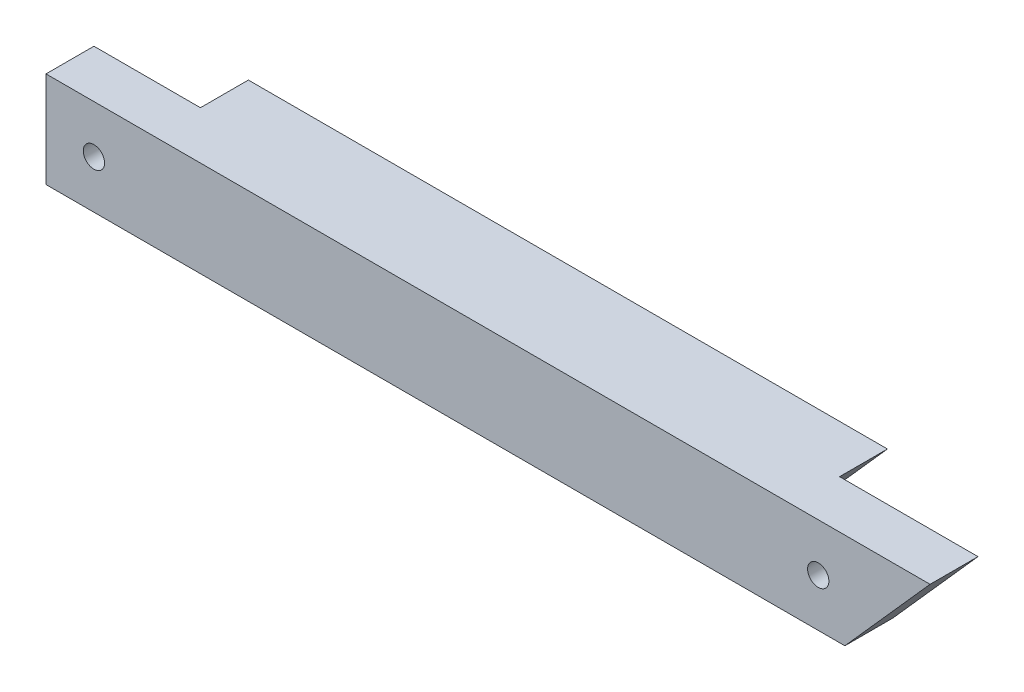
from build123d import *

# Parameters (mm, degrees)
ESQUISSE1_W             = 83
ESQUISSE1_H             = 9
EXTRUSION1_DEPTH        = 9
ESQUISSE2_W             = 10
ESQUISSE2_H             = 9
ENL_V_MAT_EXTRU_1_DEPTH = 4.5
ESQUISSE3_R             = 1
ENL_V_MAT_EXTRU_2_DEPTH = 4.5
ENL_V_MAT_EXTRU_3_DEPTH = 9
ENL_V_MAT_EXTRU_4_DEPTH = 4.5
ESQUISSE6_R             = 1
ENL_V_MAT_EXTRU_5_DEPTH = 4.5


with BuildPart() as part:
    # Esquisse1 → Extrusion1 (new body)
    with BuildSketch(Plane.XY):
        with Locations((41.5, 4.5)):
            Rectangle(ESQUISSE1_W, ESQUISSE1_H)
    extrude(amount=EXTRUSION1_DEPTH)

    # Esquisse2 → Enl_v. mat.-Extru.1 (cut)
    with BuildSketch(Plane(origin=(0, 0, 0), x_dir=(-1, 0, 0), z_dir=(0, 0, -1))):
        with Locations((-5, 4.5)):
            Rectangle(ESQUISSE2_W, ESQUISSE2_H)
    extrude(amount=-ENL_V_MAT_EXTRU_1_DEPTH, mode=Mode.SUBTRACT)

    # Esquisse3 → Enl_v. mat.-Extru.2 (cut)
    with BuildSketch(Plane(origin=(0, 0, 4.5), x_dir=(-1, 0, 0), z_dir=(0, 0, -1))):
        with Locations((-4.5, 4.5)):
            Circle(ESQUISSE3_R)
    extrude(amount=-ENL_V_MAT_EXTRU_2_DEPTH, mode=Mode.SUBTRACT)

    # Esquisse4 → Enl_v. mat.-Extru.3 (cut)
    with BuildSketch(Plane(origin=(0, 0, 0), x_dir=(-1, 0, 0), z_dir=(0, 0, -1))):
        Polygon((-83, 0), (-75, 0), (-83, 9), align=None)
    extrude(amount=-ENL_V_MAT_EXTRU_3_DEPTH, mode=Mode.SUBTRACT)

    # Esquisse5 → Enl_v. mat.-Extru.4 (cut)
    with BuildSketch(Plane(origin=(0, 0, 0), x_dir=(-1, 0, 0), z_dir=(0, 0, -1))):
        Polygon((-83, 9), (-70, 9), (-62, 0), (-75, 0), align=None)
    extrude(amount=-ENL_V_MAT_EXTRU_4_DEPTH, mode=Mode.SUBTRACT)

    # Esquisse6 → Enl_v. mat.-Extru.5 (cut)
    with BuildSketch(Plane(origin=(0, 0, 4.5), x_dir=(-1, 0, 0), z_dir=(0, 0, -1))):
        with Locations((-72.5, 4.5)):
            Circle(ESQUISSE6_R)
    extrude(amount=-ENL_V_MAT_EXTRU_5_DEPTH, mode=Mode.SUBTRACT)


solid = part.part
